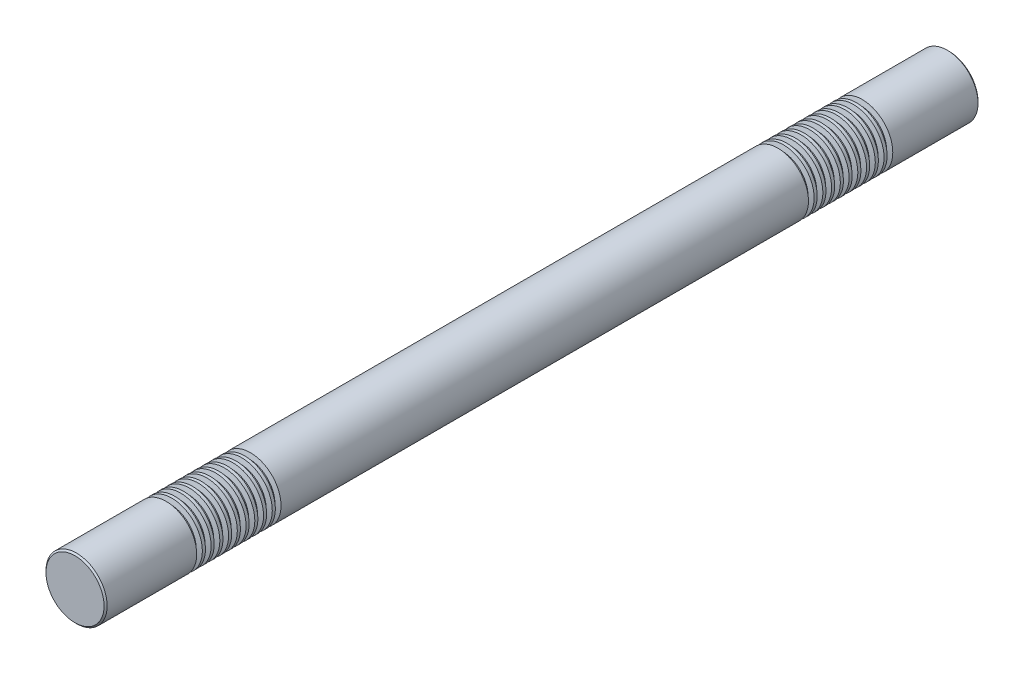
from build123d import *

# Parameters (mm, degrees)
SKETCH1_R           = 35
BOSS_EXTRUDE1_DEPTH = 500
CHAMFER1_SIZE       = 1.75
LPATTERN1_COUNT     = 10
LPATTERN1_PITCH     = 10
LPATTERN2_COUNT     = 2
LPATTERN2_PITCH     = 700


with BuildPart() as part:
    # Sketch1 → Boss-Extrude1 (new, symmetric)
    with BuildSketch(Plane.XY):
        Circle(SKETCH1_R)
    extrude(amount=BOSS_EXTRUDE1_DEPTH, both=True)

    # Chamfer1
    chamfer1_edges = [part.edges().sort_by_distance(p)[0] for p in [
        (-35, 0, -500),
        (-35, 0, 500),
    ]]
    chamfer(chamfer1_edges, length=CHAMFER1_SIZE)

    # Sketch2 → Cut-Revolve1 (revolve, cut)
    with BuildSketch(Plane(origin=(0, 0, 0), x_dir=(0, 0, -1), z_dir=(1, 0, 0)), mode=Mode.PRIVATE) as cut_revolve1_sk:
        Polygon((400.736860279, 35), (394.263139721, 35), (395.736860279, 29.5), (399.263139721, 29.5), align=None)
    cut_revolve1 = revolve(cut_revolve1_sk.sketch.rotate(Axis((0, 0, 500), (0, 0, -1)), 90), axis=Axis((0, 0, 500), (0, 0, -1)), mode=Mode.SUBTRACT)

    # LPattern1: Cut-Revolve1 ×10
    with Locations(*[(0, 0, i * LPATTERN1_PITCH) for i in range(1, LPATTERN1_COUNT)]):
        add(cut_revolve1, mode=Mode.SUBTRACT)

    # LPattern2: Cut-Revolve1 ×2
    with Locations(*[(0, 0, i * LPATTERN2_PITCH) for i in range(1, LPATTERN2_COUNT)]):
        add(cut_revolve1, mode=Mode.SUBTRACT)

    # LPattern2 copy 1 sketch → LPattern2 copy 1 (revolve, cut)
    with BuildSketch(Plane(origin=(0, 0, 710), x_dir=(0, 0, -1), z_dir=(1, 0, 0))):
        Polygon((400.736860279, 35), (394.263139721, 35), (395.736860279, 29.5), (399.263139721, 29.5), align=None)
    revolve(axis=Axis((0, 0, 1210), (0, 0, -1)), mode=Mode.SUBTRACT)

    # LPattern2 copy 2 sketch → LPattern2 copy 2 (revolve, cut)
    with BuildSketch(Plane(origin=(0, 0, 720), x_dir=(0, 0, -1), z_dir=(1, 0, 0))):
        Polygon((400.736860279, 35), (394.263139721, 35), (395.736860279, 29.5), (399.263139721, 29.5), align=None)
    revolve(axis=Axis((0, 0, 1220), (0, 0, -1)), mode=Mode.SUBTRACT)

    # LPattern2 copy 3 sketch → LPattern2 copy 3 (revolve, cut)
    with BuildSketch(Plane(origin=(0, 0, 730), x_dir=(0, 0, -1), z_dir=(1, 0, 0))):
        Polygon((400.736860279, 35), (394.263139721, 35), (395.736860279, 29.5), (399.263139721, 29.5), align=None)
    revolve(axis=Axis((0, 0, 1230), (0, 0, -1)), mode=Mode.SUBTRACT)

    # LPattern2 copy 4 sketch → LPattern2 copy 4 (revolve, cut)
    with BuildSketch(Plane(origin=(0, 0, 740), x_dir=(0, 0, -1), z_dir=(1, 0, 0))):
        Polygon((400.736860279, 35), (394.263139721, 35), (395.736860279, 29.5), (399.263139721, 29.5), align=None)
    revolve(axis=Axis((0, 0, 1240), (0, 0, -1)), mode=Mode.SUBTRACT)

    # LPattern2 copy 5 sketch → LPattern2 copy 5 (revolve, cut)
    with BuildSketch(Plane(origin=(0, 0, 750), x_dir=(0, 0, -1), z_dir=(1, 0, 0))):
        Polygon((400.736860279, 35), (394.263139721, 35), (395.736860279, 29.5), (399.263139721, 29.5), align=None)
    revolve(axis=Axis((0, 0, 1250), (0, 0, -1)), mode=Mode.SUBTRACT)

    # LPattern2 copy 6 sketch → LPattern2 copy 6 (revolve, cut)
    with BuildSketch(Plane(origin=(0, 0, 760), x_dir=(0, 0, -1), z_dir=(1, 0, 0))):
        Polygon((400.736860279, 35), (394.263139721, 35), (395.736860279, 29.5), (399.263139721, 29.5), align=None)
    revolve(axis=Axis((0, 0, 1260), (0, 0, -1)), mode=Mode.SUBTRACT)

    # LPattern2 copy 7 sketch → LPattern2 copy 7 (revolve, cut)
    with BuildSketch(Plane(origin=(0, 0, 770), x_dir=(0, 0, -1), z_dir=(1, 0, 0))):
        Polygon((400.736860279, 35), (394.263139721, 35), (395.736860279, 29.5), (399.263139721, 29.5), align=None)
    revolve(axis=Axis((0, 0, 1270), (0, 0, -1)), mode=Mode.SUBTRACT)

    # LPattern2 copy 8 sketch → LPattern2 copy 8 (revolve, cut)
    with BuildSketch(Plane(origin=(0, 0, 780), x_dir=(0, 0, -1), z_dir=(1, 0, 0))):
        Polygon((400.736860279, 35), (394.263139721, 35), (395.736860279, 29.5), (399.263139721, 29.5), align=None)
    revolve(axis=Axis((0, 0, 1280), (0, 0, -1)), mode=Mode.SUBTRACT)

    # LPattern2 copy 9 sketch → LPattern2 copy 9 (revolve, cut)
    with BuildSketch(Plane(origin=(0, 0, 790), x_dir=(0, 0, -1), z_dir=(1, 0, 0))):
        Polygon((400.736860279, 35), (394.263139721, 35), (395.736860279, 29.5), (399.263139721, 29.5), align=None)
    revolve(axis=Axis((0, 0, 1290), (0, 0, -1)), mode=Mode.SUBTRACT)


solid = part.part
